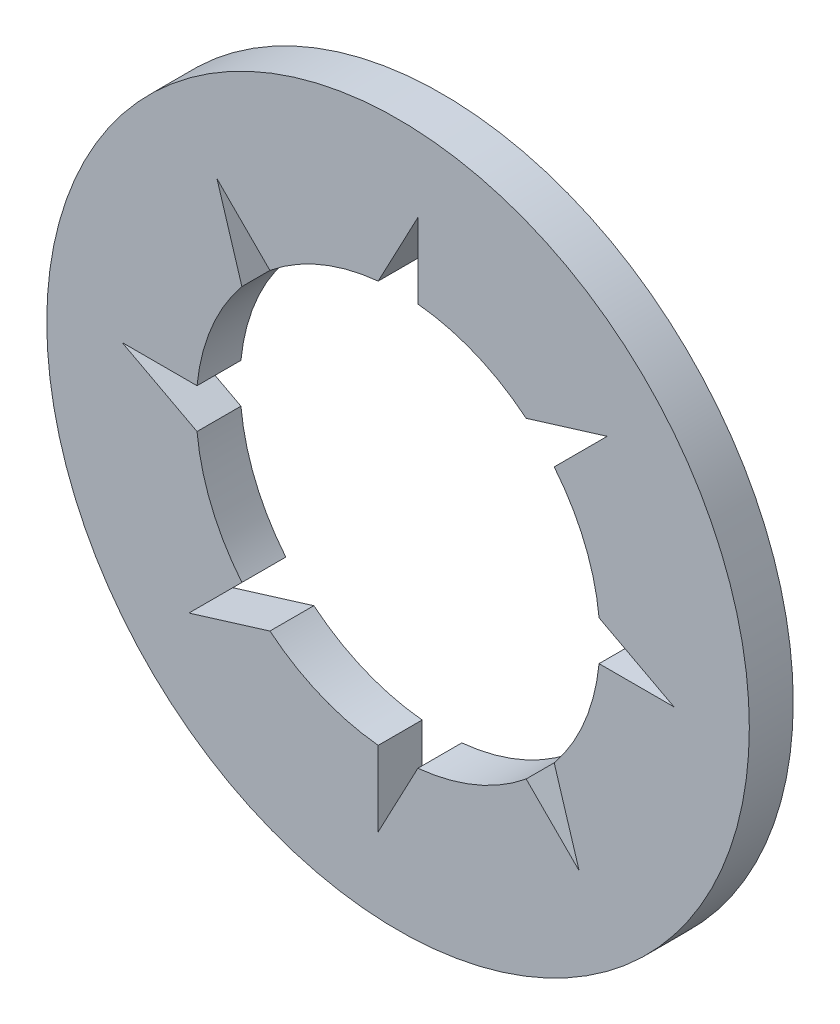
from build123d import *

# Parameters (mm, degrees)
SKETCH1_R          = 4
SKETCH1_R_2        = 2.3
BASE_EXTRUDE_DEPTH = 0.5
TYPEBSLOT_DEPTH    = 10.998980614
TYPEBPATTERN_COUNT = 8


with BuildPart() as part:
    # Sketch1 → Base-Extrude (new body)
    with BuildSketch(Plane.XY):
        Circle(SKETCH1_R)
        Circle(SKETCH1_R_2, mode=Mode.SUBTRACT)
    extrude(amount=-BASE_EXTRUDE_DEPTH)

    # Sketch2 → TypeBSlot (cut, through all)
    with BuildSketch(Plane(origin=(-3.649718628, 2.419612, 0), x_dir=(1, 0, 0), z_dir=(0, 0, 1))):
        Polygon((3.875520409, -0.130722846), (3.875520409, 0.722284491), (3.423916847, -0.130722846), align=None)
    typebslot = extrude(amount=-TYPEBSLOT_DEPTH, mode=Mode.SUBTRACT)

    # TypeBPattern: TypeBSlot ×8 about axis
    typebpattern_axis = Axis((0, 0, 0), (0, 0, 1))
    for i in range(1, TYPEBPATTERN_COUNT):
        add(typebslot.rotate(typebpattern_axis, i * 360 / TYPEBPATTERN_COUNT), mode=Mode.SUBTRACT)


solid = part.part
